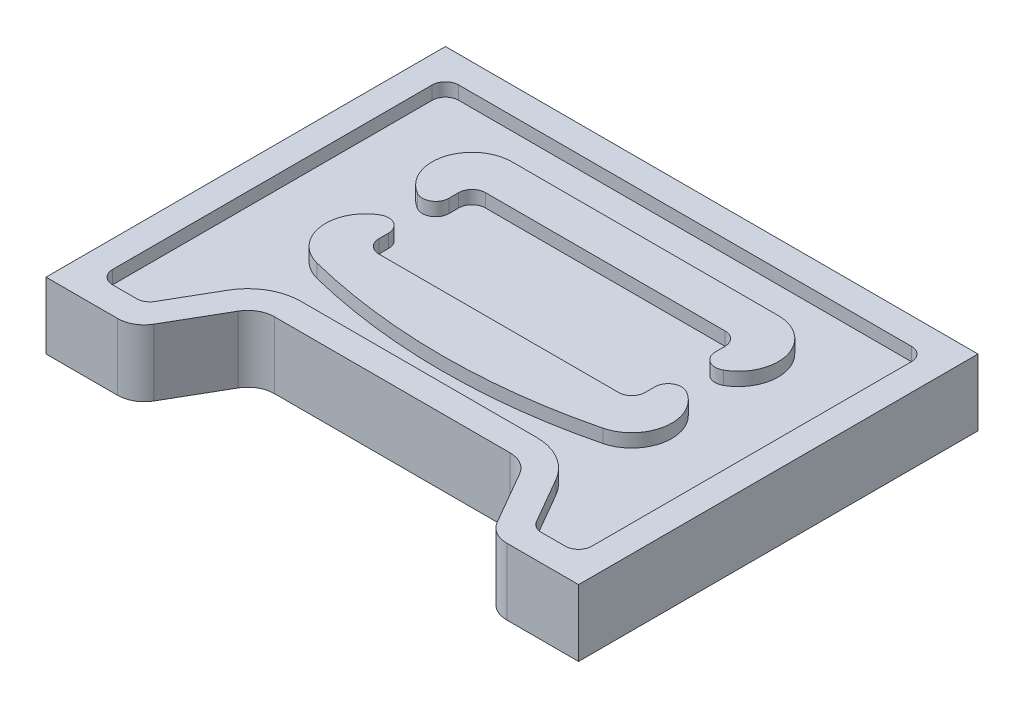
from build123d import *

# Parameters (mm, degrees)
BOSS_EXTRUDE1_DEPTH = 25
CUT_EXTRUDE1_DEPTH  = 5
BOSS_EXTRUDE2_DEPTH = 5
CUT_EXTRUDE2_DEPTH  = 3
FILLET1_R           = 5


with BuildPart() as part:
    # Sketch1 → Boss-Extrude1 (new body)
    with BuildSketch(Plane(origin=(0, 0, 0), x_dir=(1, 0, 0), z_dir=(0, 1, 0))):
        with BuildLine():
            Line((-64.43375673, -70), (-52.886751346, -50))
            ThreePointArc((-52.886751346, -50), (-49.226497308, -46.339745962), (-44.226497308, -45))
            Line((-44.226497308, -45), (44.226497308, -45))
            ThreePointArc((44.226497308, -45), (49.226497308, -46.339745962), (52.886751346, -50))
            Line((52.886751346, -50), (64.43375673, -70))
            ThreePointArc((64.43375673, -70), (68.094010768, -73.660254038), (73.094010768, -75))
            Line((73.094010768, -75), (100, -75))
            Line((100, -75), (100, 75))
            Line((100, 75), (-100, 75))
            Line((-100, 75), (-100, -75))
            Line((-100, -75), (-73.094010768, -75))
            ThreePointArc((-73.094010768, -75), (-68.094010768, -73.660254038), (-64.43375673, -70))
        make_face()
    extrude(amount=BOSS_EXTRUDE1_DEPTH)

    # Sketch2 → Cut-Extrude1 (cut)
    with BuildSketch(Plane(origin=(0, 25, 0), x_dir=(1, 0, 0), z_dir=(0, 1, 0))):
        with BuildLine():
            Line((90, -60), (90, 60))
            ThreePointArc((90, 60), (88.535533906, 63.535533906), (85, 65))
            Line((85, 65), (-85, 65))
            ThreePointArc((-85, 65), (-88.535533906, 63.535533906), (-90, 60))
            Line((-90, 60), (-90, -60))
            ThreePointArc((-90, -60), (-88.535533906, -63.535533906), (-85, -65))
            Line((-85, -65), (-75.980762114, -65))
            ThreePointArc((-75.980762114, -65), (-73.480762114, -64.330127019), (-71.650635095, -62.5))
            Line((-71.650635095, -62.5), (-61.547005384, -45))
            ThreePointArc((-61.547005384, -45), (-54.226497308, -37.679491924), (-44.226497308, -35))
            Line((-44.226497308, -35), (44.226497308, -35))
            ThreePointArc((44.226497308, -35), (54.226497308, -37.679491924), (61.547005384, -45))
            Line((61.547005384, -45), (71.650635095, -62.5))
            ThreePointArc((71.650635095, -62.5), (73.480762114, -64.330127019), (75.980762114, -65))
            Line((75.980762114, -65), (85, -65))
            ThreePointArc((85, -65), (88.535533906, -63.535533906), (90, -60))
        make_face()
    extrude(amount=-CUT_EXTRUDE1_DEPTH, mode=Mode.SUBTRACT)

    # Sketch3 → Boss-Extrude2 (add)
    with BuildSketch(Plane(origin=(0, 20, 0), x_dir=(1, 0, 0), z_dir=(0, 1, 0))):
        with BuildLine():
            Line((-50, 50), (50, 50))
            ThreePointArc((50, 50), (64.488887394, 38.882285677), (57.5, 22.009618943))
            ThreePointArc((57.5, 22.009618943), (52.5, 22.009618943), (50, 26.339745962))
            Line((50, 26.339745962), (50, 35))
            Line((50, 35), (-50, 35))
            Line((-50, 35), (-50, 26.339745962))
            ThreePointArc((-50, 26.339745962), (-52.5, 22.009618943), (-57.5, 22.009618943))
            ThreePointArc((-57.5, 22.009618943), (-64.488887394, 38.882285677), (-50, 50))
        make_face()
        with BuildLine():
            Line((-50, -5), (50, -5))
            Line((50, -5), (50, 3.660254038))
            ThreePointArc((50, 3.660254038), (52.5, 7.990381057), (57.5, 7.990381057))
            ThreePointArc((57.5, 7.990381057), (64.85454595, -7.083858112), (53.636153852, -19.552607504))
            ThreePointArc((53.636153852, -19.552607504), (0, -26.152001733), (-53.636153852, -19.552607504))
            ThreePointArc((-53.636153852, -19.552607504), (-64.85454595, -7.083858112), (-57.5, 7.990381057))
            ThreePointArc((-57.5, 7.990381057), (-52.5, 7.990381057), (-50, 3.660254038))
            Line((-50, 3.660254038), (-50, -5))
        make_face()
    extrude(amount=BOSS_EXTRUDE2_DEPTH)

    # Sketch4 → Cut-Extrude2 (cut)
    with BuildSketch(Plane(origin=(0, 0, -75), x_dir=(-1, 0, 0), z_dir=(0, 0, -1))):
        with BuildLine():
            Line((-62.5, 20.5), (62.5, 20.5))
            ThreePointArc((62.5, 20.5), (70.5, 12.5), (62.5, 4.5))
            Line((62.5, 4.5), (-62.5, 4.5))
            ThreePointArc((-62.5, 4.5), (-70.5, 12.5), (-62.5, 20.5))
        make_face()
    extrude(amount=-CUT_EXTRUDE2_DEPTH, mode=Mode.SUBTRACT)

    # Fillet1
    fillet1_edges = [part.edges().sort_by_distance(p)[0] for p in [
        (50, 22.5, 5),
        (-50, 22.5, 5),
        (-50, 22.5, -35),
        (50, 22.5, -35),
    ]]
    fillet(fillet1_edges, radius=FILLET1_R)


solid = part.part
